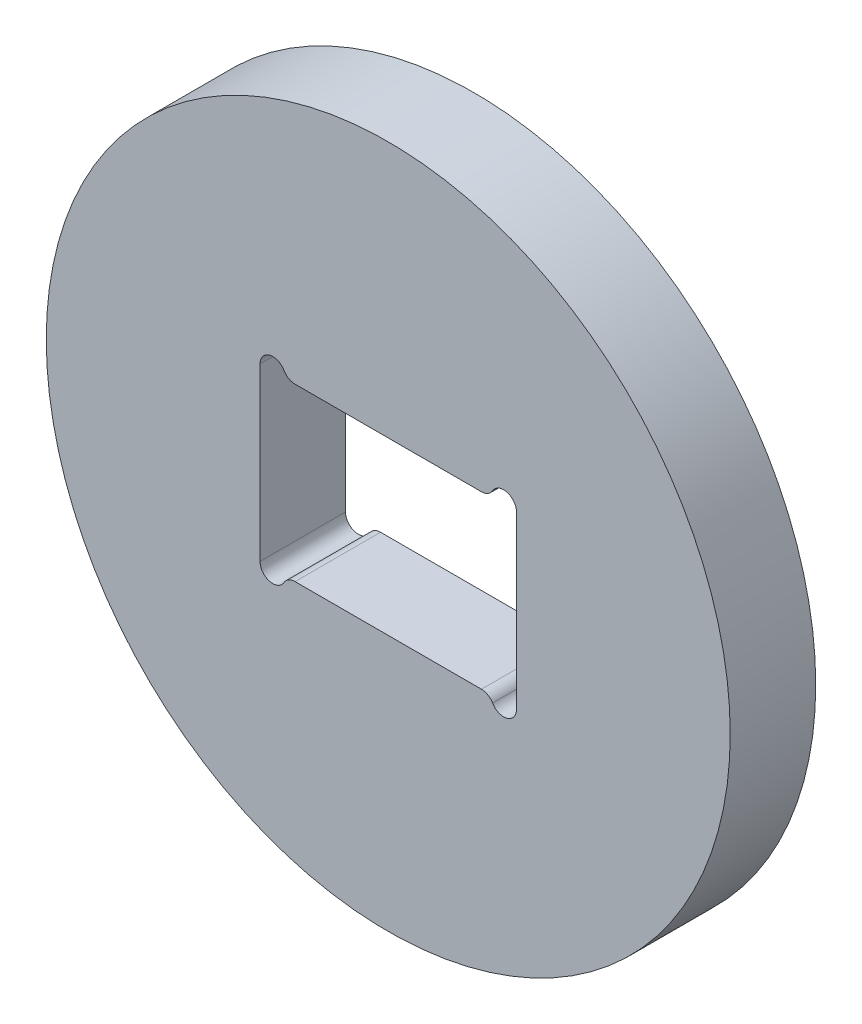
from build123d import *

# Parameters (mm, degrees)
ESQUISSE1_R        = 40
BOSS_EXTRU_1_DEPTH = 10


with BuildPart() as part:
    # Esquisse1 → Boss.-Extru.1 (new body)
    with BuildSketch(Plane.XY):
        Circle(ESQUISSE1_R)
        with BuildLine():
            Line((-10.901923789, 10), (10.901923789, 10))
            ThreePointArc((10.901923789, 10), (11.651923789, 10.200961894), (12.200961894, 10.75))
            ThreePointArc((12.200961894, 10.75), (13.888228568, 11.448888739), (15, 10))
            Line((15, 10), (15, -10))
            ThreePointArc((15, -10), (13.888228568, -11.448888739), (12.200961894, -10.75))
            ThreePointArc((12.200961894, -10.75), (11.651923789, -10.200961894), (10.901923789, -10))
            Line((10.901923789, -10), (-10.901923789, -10))
            ThreePointArc((-10.901923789, -10), (-11.651923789, -10.200961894), (-12.200961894, -10.75))
            ThreePointArc((-12.200961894, -10.75), (-13.888228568, -11.448888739), (-15, -10))
            Line((-15, -10), (-15, 10))
            ThreePointArc((-15, 10), (-13.888228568, 11.448888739), (-12.200961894, 10.75))
            ThreePointArc((-12.200961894, 10.75), (-11.651923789, 10.200961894), (-10.901923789, 10))
        make_face(mode=Mode.SUBTRACT)
    extrude(amount=BOSS_EXTRU_1_DEPTH)


solid = part.part
